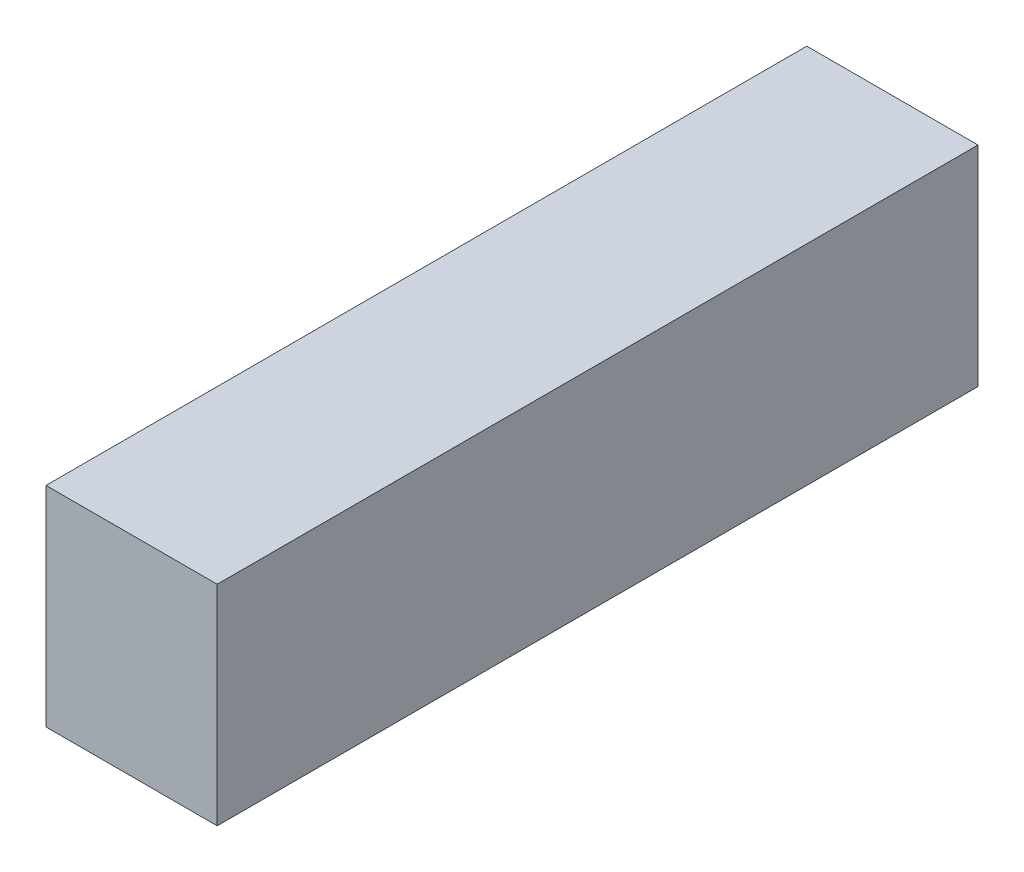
ISO-10303-21;
HEADER;
FILE_DESCRIPTION(('STEP AP214'),'2;1');
FILE_NAME('part.step','',(''),(''),'','','');
FILE_SCHEMA(('AUTOMOTIVE_DESIGN { 1 0 10303 214 1 1 1 1 }'));
ENDSEC;
DATA;
#1=APPLICATION_CONTEXT('core data for automotive mechanical design processes');
#2=APPLICATION_PROTOCOL_DEFINITION('international standard','automotive_design',2000,#1);
#3=PRODUCT_CONTEXT('',#1,'mechanical');
#4=PRODUCT('Part','Part','',(#3));
#5=PRODUCT_RELATED_PRODUCT_CATEGORY('part','',(#4));
#6=PRODUCT_DEFINITION_FORMATION('','',#4);
#7=PRODUCT_DEFINITION_CONTEXT('part definition',#1,'design');
#8=PRODUCT_DEFINITION('design','',#6,#7);
#9=PRODUCT_DEFINITION_SHAPE('','',#8);
#10=(LENGTH_UNIT() NAMED_UNIT(*) SI_UNIT(.MILLI.,.METRE.));
#11=(NAMED_UNIT(*) PLANE_ANGLE_UNIT() SI_UNIT($,.RADIAN.));
#12=(NAMED_UNIT(*) SI_UNIT($,.STERADIAN.) SOLID_ANGLE_UNIT());
#13=UNCERTAINTY_MEASURE_WITH_UNIT(LENGTH_MEASURE(1.E-05),#10,'distance_accuracy_value','');
#14=(GEOMETRIC_REPRESENTATION_CONTEXT(3) GLOBAL_UNCERTAINTY_ASSIGNED_CONTEXT((#13)) GLOBAL_UNIT_ASSIGNED_CONTEXT((#10,
#11,#12)) REPRESENTATION_CONTEXT('',''));
#15=CARTESIAN_POINT('',(0.,0.,0.));
#16=DIRECTION('',(0.,0.,1.));
#17=DIRECTION('',(1.,0.,0.));
#18=AXIS2_PLACEMENT_3D('',#15,#16,#17);
#19=CARTESIAN_POINT('',(0.,0.,508.));
#20=DIRECTION('',(1.,0.,0.));
#21=DIRECTION('',(0.,1.,0.));
#22=AXIS2_PLACEMENT_3D('',#19,#20,#21);
#23=PLANE('',#22);
#24=DIRECTION('',(0.,-1.,0.));
#25=VECTOR('',#24,1.);
#26=CARTESIAN_POINT('',(0.,0.,0.));
#27=LINE('',#26,#25);
#28=CARTESIAN_POINT('',(0.,139.7,0.));
#29=VERTEX_POINT('',#28);
#30=CARTESIAN_POINT('',(0.,0.,0.));
#31=VERTEX_POINT('',#30);
#32=EDGE_CURVE('E102',#29,#31,#27,.T.);
#33=ORIENTED_EDGE('',*,*,#32,.T.);
#34=DIRECTION('',(0.,0.,-1.));
#35=VECTOR('',#34,1.);
#36=CARTESIAN_POINT('',(0.,0.,508.));
#37=LINE('',#36,#35);
#38=CARTESIAN_POINT('',(0.,0.,508.));
#39=VERTEX_POINT('',#38);
#40=EDGE_CURVE('E11',#39,#31,#37,.T.);
#41=ORIENTED_EDGE('',*,*,#40,.F.);
#42=DIRECTION('',(0.,-1.,0.));
#43=VECTOR('',#42,1.);
#44=CARTESIAN_POINT('',(0.,0.,508.));
#45=LINE('',#44,#43);
#46=CARTESIAN_POINT('',(0.,139.7,508.));
#47=VERTEX_POINT('',#46);
#48=EDGE_CURVE('E90',#47,#39,#45,.T.);
#49=ORIENTED_EDGE('',*,*,#48,.F.);
#50=DIRECTION('',(0.,0.,-1.));
#51=VECTOR('',#50,1.);
#52=CARTESIAN_POINT('',(0.,139.7,508.));
#53=LINE('',#52,#51);
#54=EDGE_CURVE('E98',#47,#29,#53,.T.);
#55=ORIENTED_EDGE('',*,*,#54,.T.);
#56=EDGE_LOOP('',(#33,#41,#49,#55));
#57=FACE_BOUND('',#56,.T.);
#58=ADVANCED_FACE('F39',(#57),#23,.F.);
#59=CARTESIAN_POINT('',(0.,0.,508.));
#60=DIRECTION('',(0.,1.,0.));
#61=DIRECTION('',(0.,0.,1.));
#62=AXIS2_PLACEMENT_3D('',#59,#60,#61);
#63=PLANE('',#62);
#64=DIRECTION('',(1.,0.,0.));
#65=VECTOR('',#64,1.);
#66=CARTESIAN_POINT('',(0.,0.,0.));
#67=LINE('',#66,#65);
#68=CARTESIAN_POINT('',(114.3,0.,0.));
#69=VERTEX_POINT('',#68);
#70=EDGE_CURVE('E94',#31,#69,#67,.T.);
#71=ORIENTED_EDGE('',*,*,#70,.T.);
#72=DIRECTION('',(0.,0.,-1.));
#73=VECTOR('',#72,1.);
#74=CARTESIAN_POINT('',(114.3,0.,508.));
#75=LINE('',#74,#73);
#76=CARTESIAN_POINT('',(114.3,0.,508.));
#77=VERTEX_POINT('',#76);
#78=EDGE_CURVE('E47',#77,#69,#75,.T.);
#79=ORIENTED_EDGE('',*,*,#78,.F.);
#80=DIRECTION('',(1.,0.,0.));
#81=VECTOR('',#80,1.);
#82=CARTESIAN_POINT('',(0.,0.,508.));
#83=LINE('',#82,#81);
#84=EDGE_CURVE('E85',#39,#77,#83,.T.);
#85=ORIENTED_EDGE('',*,*,#84,.F.);
#86=ORIENTED_EDGE('',*,*,#40,.T.);
#87=EDGE_LOOP('',(#71,#79,#85,#86));
#88=FACE_BOUND('',#87,.T.);
#89=ADVANCED_FACE('F93',(#88),#63,.F.);
#90=CARTESIAN_POINT('',(114.3,0.,508.));
#91=DIRECTION('',(-1.,0.,0.));
#92=DIRECTION('',(0.,0.,1.));
#93=AXIS2_PLACEMENT_3D('',#90,#91,#92);
#94=PLANE('',#93);
#95=DIRECTION('',(0.,1.,0.));
#96=VECTOR('',#95,1.);
#97=CARTESIAN_POINT('',(114.3,0.,0.));
#98=LINE('',#97,#96);
#99=CARTESIAN_POINT('',(114.3,139.7,0.));
#100=VERTEX_POINT('',#99);
#101=EDGE_CURVE('E72',#69,#100,#98,.T.);
#102=ORIENTED_EDGE('',*,*,#101,.T.);
#103=DIRECTION('',(0.,0.,-1.));
#104=VECTOR('',#103,1.);
#105=CARTESIAN_POINT('',(114.3,139.7,508.));
#106=LINE('',#105,#104);
#107=CARTESIAN_POINT('',(114.3,139.7,508.));
#108=VERTEX_POINT('',#107);
#109=EDGE_CURVE('E95',#108,#100,#106,.T.);
#110=ORIENTED_EDGE('',*,*,#109,.F.);
#111=DIRECTION('',(0.,1.,0.));
#112=VECTOR('',#111,1.);
#113=CARTESIAN_POINT('',(114.3,0.,508.));
#114=LINE('',#113,#112);
#115=EDGE_CURVE('E88',#77,#108,#114,.T.);
#116=ORIENTED_EDGE('',*,*,#115,.F.);
#117=ORIENTED_EDGE('',*,*,#78,.T.);
#118=EDGE_LOOP('',(#102,#110,#116,#117));
#119=FACE_BOUND('',#118,.T.);
#120=ADVANCED_FACE('F96',(#119),#94,.F.);
#121=CARTESIAN_POINT('',(0.,139.7,508.));
#122=DIRECTION('',(0.,-1.,0.));
#123=DIRECTION('',(0.,0.,-1.));
#124=AXIS2_PLACEMENT_3D('',#121,#122,#123);
#125=PLANE('',#124);
#126=DIRECTION('',(-1.,0.,0.));
#127=VECTOR('',#126,1.);
#128=CARTESIAN_POINT('',(0.,139.7,0.));
#129=LINE('',#128,#127);
#130=EDGE_CURVE('E78',#100,#29,#129,.T.);
#131=ORIENTED_EDGE('',*,*,#130,.T.);
#132=ORIENTED_EDGE('',*,*,#54,.F.);
#133=DIRECTION('',(-1.,0.,0.));
#134=VECTOR('',#133,1.);
#135=CARTESIAN_POINT('',(0.,139.7,508.));
#136=LINE('',#135,#134);
#137=EDGE_CURVE('E55',#108,#47,#136,.T.);
#138=ORIENTED_EDGE('',*,*,#137,.F.);
#139=ORIENTED_EDGE('',*,*,#109,.T.);
#140=EDGE_LOOP('',(#131,#132,#138,#139));
#141=FACE_BOUND('',#140,.T.);
#142=ADVANCED_FACE('F109',(#141),#125,.F.);
#143=CARTESIAN_POINT('',(0.,0.,508.));
#144=DIRECTION('',(0.,0.,-1.));
#145=DIRECTION('',(-1.,0.,0.));
#146=AXIS2_PLACEMENT_3D('',#143,#144,#145);
#147=PLANE('',#146);
#148=ORIENTED_EDGE('',*,*,#48,.T.);
#149=ORIENTED_EDGE('',*,*,#84,.T.);
#150=ORIENTED_EDGE('',*,*,#115,.T.);
#151=ORIENTED_EDGE('',*,*,#137,.T.);
#152=EDGE_LOOP('',(#148,#149,#150,#151));
#153=FACE_BOUND('',#152,.T.);
#154=ADVANCED_FACE('F86',(#153),#147,.F.);
#155=CARTESIAN_POINT('',(0.,0.,0.));
#156=DIRECTION('',(0.,0.,-1.));
#157=DIRECTION('',(-1.,0.,0.));
#158=AXIS2_PLACEMENT_3D('',#155,#156,#157);
#159=PLANE('',#158);
#160=ORIENTED_EDGE('',*,*,#32,.F.);
#161=ORIENTED_EDGE('',*,*,#130,.F.);
#162=ORIENTED_EDGE('',*,*,#101,.F.);
#163=ORIENTED_EDGE('',*,*,#70,.F.);
#164=EDGE_LOOP('',(#160,#161,#162,#163));
#165=FACE_BOUND('',#164,.T.);
#166=ADVANCED_FACE('F112',(#165),#159,.T.);
#167=CLOSED_SHELL('',(#58,#89,#120,#142,#154,#166));
#168=MANIFOLD_SOLID_BREP('B2',#167);
#169=ADVANCED_BREP_SHAPE_REPRESENTATION('',(#18,#168),#14);
#170=SHAPE_DEFINITION_REPRESENTATION(#9,#169);
ENDSEC;
END-ISO-10303-21;
